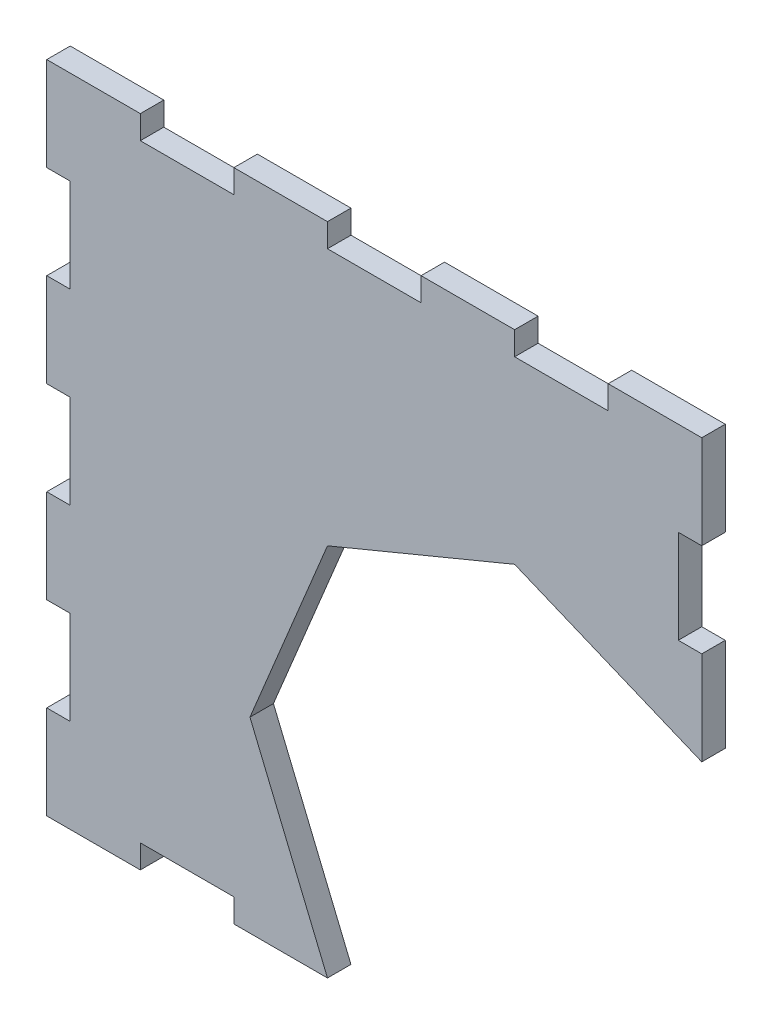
from build123d import *

# Parameters (mm, degrees)
BOSS_EXTRUDE2_DEPTH = 19


with BuildPart() as part:
    # Sketch1 → Boss-Extrude2 (new body)
    with BuildSketch(Plane.XY):
        Polygon((-882.702294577, 200.200428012), (-806.988008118, 200.200428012), (-806.988008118, 181.200427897), (-731.273721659, 181.200427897), (-731.273721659, 200.200428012), (-655.5594352, 200.200428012), (-655.5594352, 124.486141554), (-674.559435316, 124.486141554), (-674.559435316, 48.771855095), (-655.5594352, 48.771855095), (-655.5594352, -26.942431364), (-806.988008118, 35.781337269), (-958.416581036, -26.942431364), (-1021.140349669, -178.371004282), (-958.416581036, -329.799577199), (-1034.130867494, -329.799577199), (-1034.130867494, -310.799577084), (-1109.845153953, -310.799577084), (-1109.845153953, -329.799577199), (-1185.559440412, -329.799577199), (-1185.559440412, -254.08529074), (-1166.559440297, -254.08529074), (-1166.559440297, -178.371004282), (-1185.559440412, -178.371004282), (-1185.559440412, -102.656717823), (-1166.559440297, -102.656717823), (-1166.559440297, -26.942431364), (-1185.559440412, -26.942431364), (-1185.559440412, 48.771855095), (-1166.559440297, 48.771855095), (-1166.559440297, 124.486141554), (-1185.559440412, 124.486141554), (-1185.559440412, 200.200428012), (-1109.845153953, 200.200428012), (-1109.845153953, 181.200427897), (-1034.130867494, 181.200427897), (-1034.130867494, 200.200428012), (-958.416581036, 200.200428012), (-958.416581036, 181.200427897), (-882.702294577, 181.200427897), align=None)
    extrude(amount=BOSS_EXTRUDE2_DEPTH)


solid = part.part
